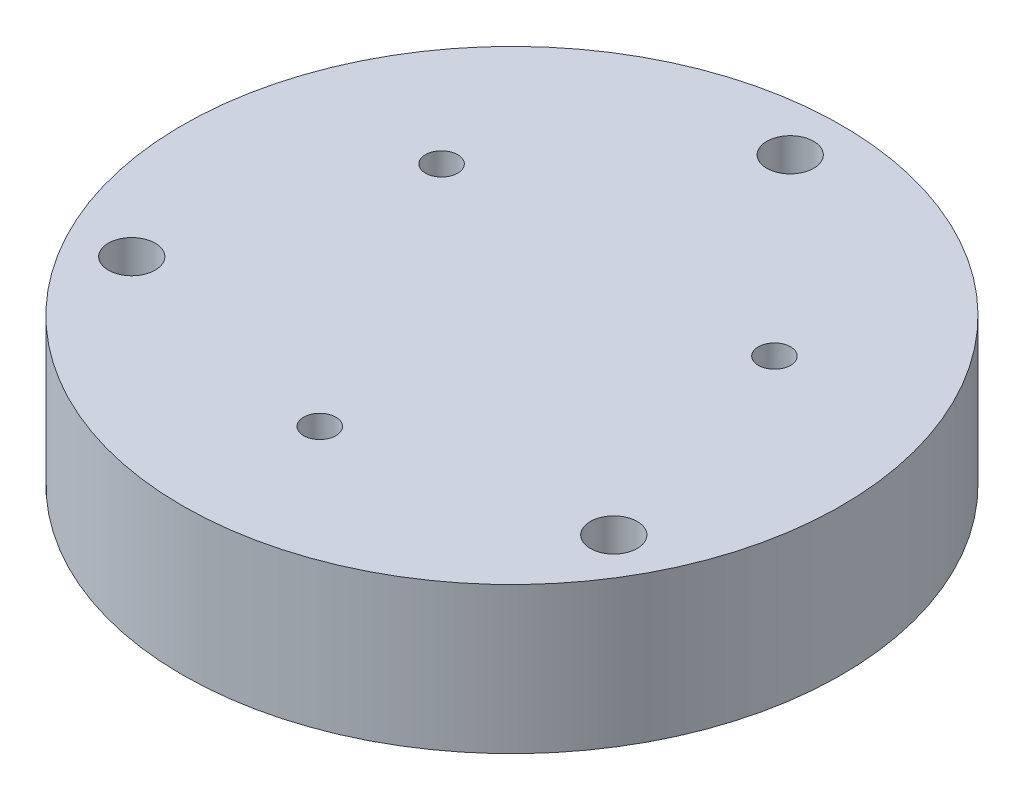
from build123d import *

# Parameters (mm, degrees)
ESQUISSE1_R             = 22.5
ESQUISSE1_R_2           = 1.6
ESQUISSE1_R_3           = 1.1
EXTRUSION1_DEPTH        = 10
ESQUISSE2_R             = 15.7
ENL_V_MAT_EXTRU_1_DEPTH = 2
ESQUISSE3_R             = 10.5
ENL_V_MAT_EXTRU_2_DEPTH = 6


with BuildPart() as part:
    # Esquisse1 → Extrusion1 (new body)
    with BuildSketch(Plane(origin=(0, 0, 0), x_dir=(1, 0, 0), z_dir=(0, 1, 0))):
        with Locations(Location((0, 0, 0), (0, 0, 270))):
            Circle(ESQUISSE1_R)
        with Locations(Location((0, 19, 0), (0, 0, 270))):
            Circle(ESQUISSE1_R_2, mode=Mode.SUBTRACT)
        with Locations(Location((16.454482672, -9.5, 0), (0, 0, 270))):
            Circle(ESQUISSE1_R_2, mode=Mode.SUBTRACT)
        with Locations(Location((-16.454482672, -9.5, 0), (0, 0, 270))):
            Circle(ESQUISSE1_R_2, mode=Mode.SUBTRACT)
        with Locations(Location((0, -13.119224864, 0), (0, 0, 270))):
            Circle(ESQUISSE1_R_3, mode=Mode.SUBTRACT)
        with Locations(Location((-11.36158201, 6.559612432, 0), (0, 0, 270))):
            Circle(ESQUISSE1_R_3, mode=Mode.SUBTRACT)
        with Locations(Location((11.36158201, 6.559612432, 0), (0, 0, 270))):
            Circle(ESQUISSE1_R_3, mode=Mode.SUBTRACT)
    extrude(amount=EXTRUSION1_DEPTH)

    # Esquisse2 → Enl_v. mat.-Extru.1 (cut)
    with BuildSketch(Plane.XZ):
        with Locations(Location((0, 0, 0), (0, 0, 270))):
            Circle(ESQUISSE2_R)
    extrude(amount=-ENL_V_MAT_EXTRU_1_DEPTH, mode=Mode.SUBTRACT)

    # Esquisse3 → Enl_v. mat.-Extru.2 (cut)
    with BuildSketch(Plane.XZ.offset(-2)):
        with Locations(Location((0, 0, 0), (0, 0, 270))):
            Circle(ESQUISSE3_R)
    extrude(amount=-ENL_V_MAT_EXTRU_2_DEPTH, mode=Mode.SUBTRACT)


solid = part.part
